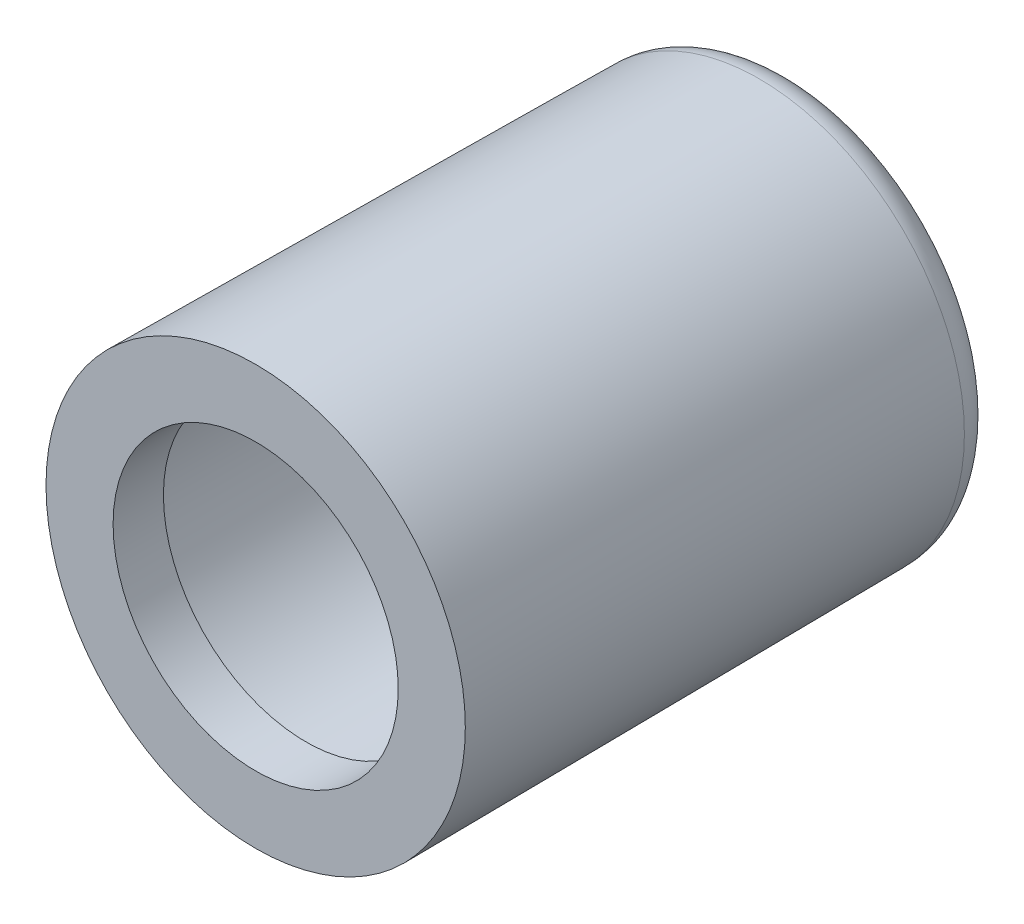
from build123d import *

# Parameters (mm, degrees)
ESQUISSE1_R             = 12.5
BASE_EXTRUSION_DEPTH    = 32
BASE_EXTRUSION_DRAFT    = -0.5
ESQUISSE2_R             = 10
ENL_V_MAT_EXTRU_1_DEPTH = 29
ESQUISSE3_R             = 8.5
ENL_V_MAT_EXTRU_2_DEPTH = 34.963215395
CONG_1_R                = 2


with BuildPart() as part:
    # Esquisse1 → Base-Extrusion (with draft: the straight prism first)
    with BuildSketch(Plane.XY):
        Circle(ESQUISSE1_R)
    extrude(amount=-BASE_EXTRUSION_DEPTH)
    # Base-Extrusion: the draft: its side faces are tilted about the plane it starts from
    base_extrusion_sides = [part.faces().sort_by_distance(p)[0] for p in [
        (-12.5, 0, -16),
    ]]
    draft(base_extrusion_sides, Plane.XY, BASE_EXTRUSION_DRAFT)

    # Esquisse2 → Enl_v. mat.-Extru.1 (cut)
    with BuildSketch(Plane(origin=(0, 0, -32), x_dir=(-1, 0, 0), z_dir=(0, 0, -1))):
        Circle(ESQUISSE2_R)
    extrude(amount=-ENL_V_MAT_EXTRU_1_DEPTH, mode=Mode.SUBTRACT)

    # Esquisse3 → Enl_v. mat.-Extru.2 (cut, through all)
    with BuildSketch(Plane(origin=(0, 0, -3), x_dir=(-1, 0, 0), z_dir=(0, 0, -1))):
        Circle(ESQUISSE3_R)
    extrude(amount=-ENL_V_MAT_EXTRU_2_DEPTH, mode=Mode.SUBTRACT)

    # Cong_1
    cong_1_edges = [part.edges().sort_by_distance(p)[0] for p in [
        (-12.220740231, 0, -32),
    ]]
    fillet(cong_1_edges, radius=CONG_1_R)


solid = part.part
